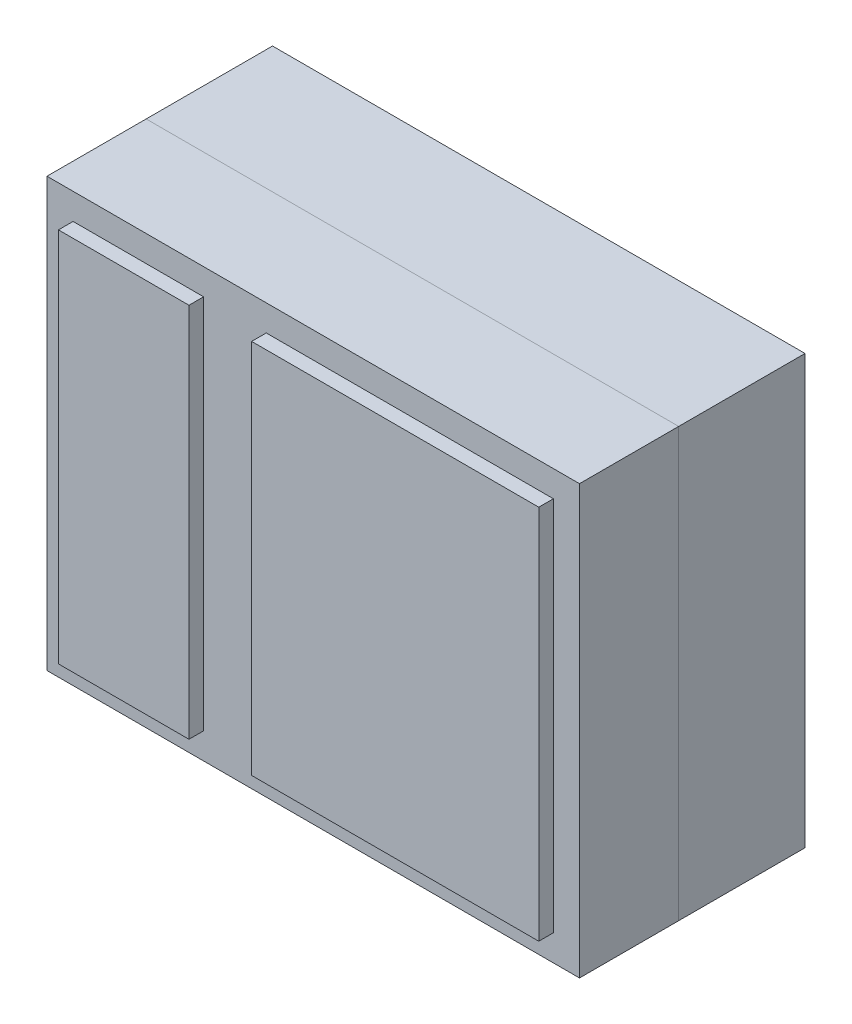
ISO-10303-21;
HEADER;
FILE_DESCRIPTION(('STEP AP214'),'2;1');
FILE_NAME('part.step','',(''),(''),'','','');
FILE_SCHEMA(('AUTOMOTIVE_DESIGN { 1 0 10303 214 1 1 1 1 }'));
ENDSEC;
DATA;
#1=APPLICATION_CONTEXT('core data for automotive mechanical design processes');
#2=APPLICATION_PROTOCOL_DEFINITION('international standard','automotive_design',2000,#1);
#3=PRODUCT_CONTEXT('',#1,'mechanical');
#4=PRODUCT('Part','Part','',(#3));
#5=PRODUCT_RELATED_PRODUCT_CATEGORY('part','',(#4));
#6=PRODUCT_DEFINITION_FORMATION('','',#4);
#7=PRODUCT_DEFINITION_CONTEXT('part definition',#1,'design');
#8=PRODUCT_DEFINITION('design','',#6,#7);
#9=PRODUCT_DEFINITION_SHAPE('','',#8);
#10=(LENGTH_UNIT() NAMED_UNIT(*) SI_UNIT(.MILLI.,.METRE.));
#11=(NAMED_UNIT(*) PLANE_ANGLE_UNIT() SI_UNIT($,.RADIAN.));
#12=(NAMED_UNIT(*) SI_UNIT($,.STERADIAN.) SOLID_ANGLE_UNIT());
#13=UNCERTAINTY_MEASURE_WITH_UNIT(LENGTH_MEASURE(1.E-05),#10,'distance_accuracy_value','');
#14=(GEOMETRIC_REPRESENTATION_CONTEXT(3) GLOBAL_UNCERTAINTY_ASSIGNED_CONTEXT((#13)) GLOBAL_UNIT_ASSIGNED_CONTEXT((#10,
#11,#12)) REPRESENTATION_CONTEXT('',''));
#15=CARTESIAN_POINT('',(0.,0.,0.));
#16=DIRECTION('',(0.,0.,1.));
#17=DIRECTION('',(1.,0.,0.));
#18=AXIS2_PLACEMENT_3D('',#15,#16,#17);
#19=CARTESIAN_POINT('',(1.22,0.,0.92));
#20=DIRECTION('',(1.,0.,0.));
#21=DIRECTION('',(0.,1.,0.));
#22=AXIS2_PLACEMENT_3D('',#19,#20,#21);
#23=PLANE('',#22);
#24=DIRECTION('',(0.,-1.,0.));
#25=VECTOR('',#24,1.);
#26=CARTESIAN_POINT('',(1.22,0.,0.864));
#27=LINE('',#26,#25);
#28=CARTESIAN_POINT('',(1.22,0.719999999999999,0.864));
#29=VERTEX_POINT('',#28);
#30=CARTESIAN_POINT('',(1.22,-0.720000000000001,0.864));
#31=VERTEX_POINT('',#30);
#32=EDGE_CURVE('E114',#29,#31,#27,.T.);
#33=ORIENTED_EDGE('',*,*,#32,.F.);
#34=DIRECTION('',(0.,0.,-1.));
#35=VECTOR('',#34,1.);
#36=CARTESIAN_POINT('',(1.22,0.719999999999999,0.92));
#37=LINE('',#36,#35);
#38=CARTESIAN_POINT('',(1.22,0.719999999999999,0.92));
#39=VERTEX_POINT('',#38);
#40=EDGE_CURVE('E12',#39,#29,#37,.T.);
#41=ORIENTED_EDGE('',*,*,#40,.F.);
#42=DIRECTION('',(0.,-1.,0.));
#43=VECTOR('',#42,1.);
#44=CARTESIAN_POINT('',(1.22,0.,0.92));
#45=LINE('',#44,#43);
#46=CARTESIAN_POINT('',(1.22,-0.720000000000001,0.92));
#47=VERTEX_POINT('',#46);
#48=EDGE_CURVE('E108',#39,#47,#45,.T.);
#49=ORIENTED_EDGE('',*,*,#48,.T.);
#50=DIRECTION('',(0.,0.,-1.));
#51=VECTOR('',#50,1.);
#52=CARTESIAN_POINT('',(1.22,-0.720000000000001,0.92));
#53=LINE('',#52,#51);
#54=EDGE_CURVE('E53',#47,#31,#53,.T.);
#55=ORIENTED_EDGE('',*,*,#54,.T.);
#56=EDGE_LOOP('',(#33,#41,#49,#55));
#57=FACE_BOUND('',#56,.T.);
#58=ADVANCED_FACE('F50',(#57),#23,.T.);
#59=CARTESIAN_POINT('',(0.,0.719999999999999,0.92));
#60=DIRECTION('',(0.,1.,0.));
#61=DIRECTION('',(0.,0.,1.));
#62=AXIS2_PLACEMENT_3D('',#59,#60,#61);
#63=PLANE('',#62);
#64=DIRECTION('',(1.,0.,0.));
#65=VECTOR('',#64,1.);
#66=CARTESIAN_POINT('',(0.,0.719999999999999,0.864));
#67=LINE('',#66,#65);
#68=CARTESIAN_POINT('',(0.120000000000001,0.719999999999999,0.864));
#69=VERTEX_POINT('',#68);
#70=EDGE_CURVE('E110',#69,#29,#67,.T.);
#71=ORIENTED_EDGE('',*,*,#70,.F.);
#72=DIRECTION('',(0.,0.,-1.));
#73=VECTOR('',#72,1.);
#74=CARTESIAN_POINT('',(0.120000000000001,0.719999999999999,0.92));
#75=LINE('',#74,#73);
#76=CARTESIAN_POINT('',(0.120000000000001,0.719999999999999,0.92));
#77=VERTEX_POINT('',#76);
#78=EDGE_CURVE('E59',#77,#69,#75,.T.);
#79=ORIENTED_EDGE('',*,*,#78,.F.);
#80=DIRECTION('',(1.,0.,0.));
#81=VECTOR('',#80,1.);
#82=CARTESIAN_POINT('',(0.,0.719999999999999,0.92));
#83=LINE('',#82,#81);
#84=EDGE_CURVE('E105',#77,#39,#83,.T.);
#85=ORIENTED_EDGE('',*,*,#84,.T.);
#86=ORIENTED_EDGE('',*,*,#40,.T.);
#87=EDGE_LOOP('',(#71,#79,#85,#86));
#88=FACE_BOUND('',#87,.T.);
#89=ADVANCED_FACE('F124',(#88),#63,.T.);
#90=CARTESIAN_POINT('',(0.120000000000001,0.,0.92));
#91=DIRECTION('',(-1.,0.,0.));
#92=DIRECTION('',(0.,-1.,0.));
#93=AXIS2_PLACEMENT_3D('',#90,#91,#92);
#94=PLANE('',#93);
#95=DIRECTION('',(0.,1.,0.));
#96=VECTOR('',#95,1.);
#97=CARTESIAN_POINT('',(0.120000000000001,0.,0.864));
#98=LINE('',#97,#96);
#99=CARTESIAN_POINT('',(0.120000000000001,-0.720000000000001,0.864));
#100=VERTEX_POINT('',#99);
#101=EDGE_CURVE('E100',#100,#69,#98,.T.);
#102=ORIENTED_EDGE('',*,*,#101,.F.);
#103=DIRECTION('',(0.,0.,-1.));
#104=VECTOR('',#103,1.);
#105=CARTESIAN_POINT('',(0.120000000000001,-0.720000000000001,0.92));
#106=LINE('',#105,#104);
#107=CARTESIAN_POINT('',(0.120000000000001,-0.720000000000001,0.92));
#108=VERTEX_POINT('',#107);
#109=EDGE_CURVE('E95',#108,#100,#106,.T.);
#110=ORIENTED_EDGE('',*,*,#109,.F.);
#111=DIRECTION('',(0.,1.,0.));
#112=VECTOR('',#111,1.);
#113=CARTESIAN_POINT('',(0.120000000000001,0.,0.92));
#114=LINE('',#113,#112);
#115=EDGE_CURVE('E98',#108,#77,#114,.T.);
#116=ORIENTED_EDGE('',*,*,#115,.T.);
#117=ORIENTED_EDGE('',*,*,#78,.T.);
#118=EDGE_LOOP('',(#102,#110,#116,#117));
#119=FACE_BOUND('',#118,.T.);
#120=ADVANCED_FACE('F97',(#119),#94,.T.);
#121=CARTESIAN_POINT('',(0.,-0.720000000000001,0.92));
#122=DIRECTION('',(0.,-1.,0.));
#123=DIRECTION('',(1.,0.,0.));
#124=AXIS2_PLACEMENT_3D('',#121,#122,#123);
#125=PLANE('',#124);
#126=DIRECTION('',(-1.,0.,0.));
#127=VECTOR('',#126,1.);
#128=CARTESIAN_POINT('',(0.,-0.720000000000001,0.864));
#129=LINE('',#128,#127);
#130=EDGE_CURVE('E117',#31,#100,#129,.T.);
#131=ORIENTED_EDGE('',*,*,#130,.F.);
#132=ORIENTED_EDGE('',*,*,#54,.F.);
#133=DIRECTION('',(-1.,0.,0.));
#134=VECTOR('',#133,1.);
#135=CARTESIAN_POINT('',(0.,-0.720000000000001,0.92));
#136=LINE('',#135,#134);
#137=EDGE_CURVE('E104',#47,#108,#136,.T.);
#138=ORIENTED_EDGE('',*,*,#137,.T.);
#139=ORIENTED_EDGE('',*,*,#109,.T.);
#140=EDGE_LOOP('',(#131,#132,#138,#139));
#141=FACE_BOUND('',#140,.T.);
#142=ADVANCED_FACE('F107',(#141),#125,.T.);
#143=CARTESIAN_POINT('',(0.,0.,0.92));
#144=DIRECTION('',(0.,0.,-1.));
#145=DIRECTION('',(-1.,0.,0.));
#146=AXIS2_PLACEMENT_3D('',#143,#144,#145);
#147=PLANE('',#146);
#148=ORIENTED_EDGE('',*,*,#48,.F.);
#149=ORIENTED_EDGE('',*,*,#84,.F.);
#150=ORIENTED_EDGE('',*,*,#115,.F.);
#151=ORIENTED_EDGE('',*,*,#137,.F.);
#152=EDGE_LOOP('',(#148,#149,#150,#151));
#153=FACE_BOUND('',#152,.T.);
#154=ADVANCED_FACE('F103',(#153),#147,.F.);
#155=CARTESIAN_POINT('',(0.,0.,0.864));
#156=DIRECTION('',(0.,0.,-1.));
#157=DIRECTION('',(-1.,0.,0.));
#158=AXIS2_PLACEMENT_3D('',#155,#156,#157);
#159=PLANE('',#158);
#160=ORIENTED_EDGE('',*,*,#32,.T.);
#161=ORIENTED_EDGE('',*,*,#130,.T.);
#162=ORIENTED_EDGE('',*,*,#101,.T.);
#163=ORIENTED_EDGE('',*,*,#70,.T.);
#164=EDGE_LOOP('',(#160,#161,#162,#163));
#165=FACE_BOUND('',#164,.T.);
#166=ADVANCED_FACE('F123',(#165),#159,.T.);
#167=CLOSED_SHELL('',(#58,#89,#120,#142,#154,#166));
#168=MANIFOLD_SOLID_BREP('B2',#167);
#169=CARTESIAN_POINT('',(-0.12,0.,0.92));
#170=DIRECTION('',(1.,0.,0.));
#171=DIRECTION('',(0.,0.,-1.));
#172=AXIS2_PLACEMENT_3D('',#169,#170,#171);
#173=PLANE('',#172);
#174=DIRECTION('',(0.,-1.,0.));
#175=VECTOR('',#174,1.);
#176=CARTESIAN_POINT('',(-0.12,0.,0.864));
#177=LINE('',#176,#175);
#178=CARTESIAN_POINT('',(-0.12,0.719999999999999,0.864));
#179=VERTEX_POINT('',#178);
#180=CARTESIAN_POINT('',(-0.12,-0.720000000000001,0.864));
#181=VERTEX_POINT('',#180);
#182=EDGE_CURVE('E248',#179,#181,#177,.T.);
#183=ORIENTED_EDGE('',*,*,#182,.F.);
#184=DIRECTION('',(0.,0.,-1.));
#185=VECTOR('',#184,1.);
#186=CARTESIAN_POINT('',(-0.12,0.719999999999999,0.92));
#187=LINE('',#186,#185);
#188=CARTESIAN_POINT('',(-0.12,0.719999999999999,0.92));
#189=VERTEX_POINT('',#188);
#190=EDGE_CURVE('E48',#189,#179,#187,.T.);
#191=ORIENTED_EDGE('',*,*,#190,.F.);
#192=DIRECTION('',(0.,-1.,0.));
#193=VECTOR('',#192,1.);
#194=CARTESIAN_POINT('',(-0.12,0.,0.92));
#195=LINE('',#194,#193);
#196=CARTESIAN_POINT('',(-0.12,-0.720000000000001,0.92));
#197=VERTEX_POINT('',#196);
#198=EDGE_CURVE('E242',#189,#197,#195,.T.);
#199=ORIENTED_EDGE('',*,*,#198,.T.);
#200=DIRECTION('',(0.,0.,-1.));
#201=VECTOR('',#200,1.);
#202=CARTESIAN_POINT('',(-0.12,-0.720000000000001,0.92));
#203=LINE('',#202,#201);
#204=EDGE_CURVE('E187',#197,#181,#203,.T.);
#205=ORIENTED_EDGE('',*,*,#204,.T.);
#206=EDGE_LOOP('',(#183,#191,#199,#205));
#207=FACE_BOUND('',#206,.T.);
#208=ADVANCED_FACE('F184',(#207),#173,.T.);
#209=CARTESIAN_POINT('',(0.,0.719999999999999,0.92));
#210=DIRECTION('',(0.,1.,0.));
#211=DIRECTION('',(-1.,0.,0.));
#212=AXIS2_PLACEMENT_3D('',#209,#210,#211);
#213=PLANE('',#212);
#214=DIRECTION('',(1.,0.,0.));
#215=VECTOR('',#214,1.);
#216=CARTESIAN_POINT('',(0.,0.719999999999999,0.864));
#217=LINE('',#216,#215);
#218=CARTESIAN_POINT('',(-0.62,0.719999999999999,0.864));
#219=VERTEX_POINT('',#218);
#220=EDGE_CURVE('E244',#219,#179,#217,.T.);
#221=ORIENTED_EDGE('',*,*,#220,.F.);
#222=DIRECTION('',(0.,0.,-1.));
#223=VECTOR('',#222,1.);
#224=CARTESIAN_POINT('',(-0.62,0.719999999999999,0.92));
#225=LINE('',#224,#223);
#226=CARTESIAN_POINT('',(-0.62,0.719999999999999,0.92));
#227=VERTEX_POINT('',#226);
#228=EDGE_CURVE('E193',#227,#219,#225,.T.);
#229=ORIENTED_EDGE('',*,*,#228,.F.);
#230=DIRECTION('',(1.,0.,0.));
#231=VECTOR('',#230,1.);
#232=CARTESIAN_POINT('',(0.,0.719999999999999,0.92));
#233=LINE('',#232,#231);
#234=EDGE_CURVE('E239',#227,#189,#233,.T.);
#235=ORIENTED_EDGE('',*,*,#234,.T.);
#236=ORIENTED_EDGE('',*,*,#190,.T.);
#237=EDGE_LOOP('',(#221,#229,#235,#236));
#238=FACE_BOUND('',#237,.T.);
#239=ADVANCED_FACE('F258',(#238),#213,.T.);
#240=CARTESIAN_POINT('',(-0.62,0.,0.92));
#241=DIRECTION('',(-1.,0.,0.));
#242=DIRECTION('',(0.,0.,1.));
#243=AXIS2_PLACEMENT_3D('',#240,#241,#242);
#244=PLANE('',#243);
#245=DIRECTION('',(0.,1.,0.));
#246=VECTOR('',#245,1.);
#247=CARTESIAN_POINT('',(-0.62,0.,0.864));
#248=LINE('',#247,#246);
#249=CARTESIAN_POINT('',(-0.62,-0.720000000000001,0.864));
#250=VERTEX_POINT('',#249);
#251=EDGE_CURVE('E234',#250,#219,#248,.T.);
#252=ORIENTED_EDGE('',*,*,#251,.F.);
#253=DIRECTION('',(0.,0.,-1.));
#254=VECTOR('',#253,1.);
#255=CARTESIAN_POINT('',(-0.62,-0.720000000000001,0.92));
#256=LINE('',#255,#254);
#257=CARTESIAN_POINT('',(-0.62,-0.720000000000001,0.92));
#258=VERTEX_POINT('',#257);
#259=EDGE_CURVE('E229',#258,#250,#256,.T.);
#260=ORIENTED_EDGE('',*,*,#259,.F.);
#261=DIRECTION('',(0.,1.,0.));
#262=VECTOR('',#261,1.);
#263=CARTESIAN_POINT('',(-0.62,0.,0.92));
#264=LINE('',#263,#262);
#265=EDGE_CURVE('E232',#258,#227,#264,.T.);
#266=ORIENTED_EDGE('',*,*,#265,.T.);
#267=ORIENTED_EDGE('',*,*,#228,.T.);
#268=EDGE_LOOP('',(#252,#260,#266,#267));
#269=FACE_BOUND('',#268,.T.);
#270=ADVANCED_FACE('F231',(#269),#244,.T.);
#271=CARTESIAN_POINT('',(0.,-0.720000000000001,0.92));
#272=DIRECTION('',(0.,-1.,0.));
#273=DIRECTION('',(1.,0.,0.));
#274=AXIS2_PLACEMENT_3D('',#271,#272,#273);
#275=PLANE('',#274);
#276=DIRECTION('',(-1.,0.,0.));
#277=VECTOR('',#276,1.);
#278=CARTESIAN_POINT('',(0.,-0.720000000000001,0.864));
#279=LINE('',#278,#277);
#280=EDGE_CURVE('E251',#181,#250,#279,.T.);
#281=ORIENTED_EDGE('',*,*,#280,.F.);
#282=ORIENTED_EDGE('',*,*,#204,.F.);
#283=DIRECTION('',(-1.,0.,0.));
#284=VECTOR('',#283,1.);
#285=CARTESIAN_POINT('',(0.,-0.720000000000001,0.92));
#286=LINE('',#285,#284);
#287=EDGE_CURVE('E238',#197,#258,#286,.T.);
#288=ORIENTED_EDGE('',*,*,#287,.T.);
#289=ORIENTED_EDGE('',*,*,#259,.T.);
#290=EDGE_LOOP('',(#281,#282,#288,#289));
#291=FACE_BOUND('',#290,.T.);
#292=ADVANCED_FACE('F241',(#291),#275,.T.);
#293=CARTESIAN_POINT('',(0.,0.,0.92));
#294=DIRECTION('',(0.,0.,-1.));
#295=DIRECTION('',(-1.,0.,0.));
#296=AXIS2_PLACEMENT_3D('',#293,#294,#295);
#297=PLANE('',#296);
#298=ORIENTED_EDGE('',*,*,#198,.F.);
#299=ORIENTED_EDGE('',*,*,#234,.F.);
#300=ORIENTED_EDGE('',*,*,#265,.F.);
#301=ORIENTED_EDGE('',*,*,#287,.F.);
#302=EDGE_LOOP('',(#298,#299,#300,#301));
#303=FACE_BOUND('',#302,.T.);
#304=ADVANCED_FACE('F237',(#303),#297,.F.);
#305=CARTESIAN_POINT('',(0.,0.,0.864));
#306=DIRECTION('',(0.,0.,-1.));
#307=DIRECTION('',(-1.,0.,0.));
#308=AXIS2_PLACEMENT_3D('',#305,#306,#307);
#309=PLANE('',#308);
#310=ORIENTED_EDGE('',*,*,#182,.T.);
#311=ORIENTED_EDGE('',*,*,#280,.T.);
#312=ORIENTED_EDGE('',*,*,#251,.T.);
#313=ORIENTED_EDGE('',*,*,#220,.T.);
#314=EDGE_LOOP('',(#310,#311,#312,#313));
#315=FACE_BOUND('',#314,.T.);
#316=ADVANCED_FACE('F257',(#315),#309,.T.);
#317=CLOSED_SHELL('',(#208,#239,#270,#292,#304,#316));
#318=MANIFOLD_SOLID_BREP('B6',#317);
#319=CARTESIAN_POINT('',(1.32,-0.820000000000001,0.864));
#320=DIRECTION('',(-1.,0.,0.));
#321=DIRECTION('',(0.,-1.,0.));
#322=AXIS2_PLACEMENT_3D('',#319,#320,#321);
#323=PLANE('',#322);
#324=DIRECTION('',(0.,1.,0.));
#325=VECTOR('',#324,1.);
#326=CARTESIAN_POINT('',(1.32,-0.820000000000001,0.484));
#327=LINE('',#326,#325);
#328=CARTESIAN_POINT('',(1.32,-0.820000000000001,0.484));
#329=VERTEX_POINT('',#328);
#330=CARTESIAN_POINT('',(1.32,0.819999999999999,0.484));
#331=VERTEX_POINT('',#330);
#332=EDGE_CURVE('E381',#329,#331,#327,.T.);
#333=ORIENTED_EDGE('',*,*,#332,.T.);
#334=DIRECTION('',(0.,0.,-1.));
#335=VECTOR('',#334,1.);
#336=CARTESIAN_POINT('',(1.32,0.819999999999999,0.864));
#337=LINE('',#336,#335);
#338=CARTESIAN_POINT('',(1.32,0.819999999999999,0.864));
#339=VERTEX_POINT('',#338);
#340=EDGE_CURVE('E182',#339,#331,#337,.T.);
#341=ORIENTED_EDGE('',*,*,#340,.F.);
#342=DIRECTION('',(0.,1.,0.));
#343=VECTOR('',#342,1.);
#344=CARTESIAN_POINT('',(1.32,-0.820000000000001,0.864));
#345=LINE('',#344,#343);
#346=CARTESIAN_POINT('',(1.32,-0.820000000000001,0.864));
#347=VERTEX_POINT('',#346);
#348=EDGE_CURVE('E369',#347,#339,#345,.T.);
#349=ORIENTED_EDGE('',*,*,#348,.F.);
#350=DIRECTION('',(0.,0.,-1.));
#351=VECTOR('',#350,1.);
#352=CARTESIAN_POINT('',(1.32,-0.820000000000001,0.864));
#353=LINE('',#352,#351);
#354=EDGE_CURVE('E377',#347,#329,#353,.T.);
#355=ORIENTED_EDGE('',*,*,#354,.T.);
#356=EDGE_LOOP('',(#333,#341,#349,#355));
#357=FACE_BOUND('',#356,.T.);
#358=ADVANCED_FACE('F318',(#357),#323,.F.);
#359=CARTESIAN_POINT('',(1.32,0.819999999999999,0.864));
#360=DIRECTION('',(0.,-1.,0.));
#361=DIRECTION('',(0.,0.,-1.));
#362=AXIS2_PLACEMENT_3D('',#359,#360,#361);
#363=PLANE('',#362);
#364=DIRECTION('',(-1.,0.,0.));
#365=VECTOR('',#364,1.);
#366=CARTESIAN_POINT('',(1.32,0.819999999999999,0.484));
#367=LINE('',#366,#365);
#368=CARTESIAN_POINT('',(-0.72,0.819999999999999,0.484));
#369=VERTEX_POINT('',#368);
#370=EDGE_CURVE('E373',#331,#369,#367,.T.);
#371=ORIENTED_EDGE('',*,*,#370,.T.);
#372=DIRECTION('',(0.,0.,-1.));
#373=VECTOR('',#372,1.);
#374=CARTESIAN_POINT('',(-0.72,0.819999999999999,0.864));
#375=LINE('',#374,#373);
#376=CARTESIAN_POINT('',(-0.72,0.819999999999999,0.864));
#377=VERTEX_POINT('',#376);
#378=EDGE_CURVE('E326',#377,#369,#375,.T.);
#379=ORIENTED_EDGE('',*,*,#378,.F.);
#380=DIRECTION('',(-1.,0.,0.));
#381=VECTOR('',#380,1.);
#382=CARTESIAN_POINT('',(1.32,0.819999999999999,0.864));
#383=LINE('',#382,#381);
#384=EDGE_CURVE('E364',#339,#377,#383,.T.);
#385=ORIENTED_EDGE('',*,*,#384,.F.);
#386=ORIENTED_EDGE('',*,*,#340,.T.);
#387=EDGE_LOOP('',(#371,#379,#385,#386));
#388=FACE_BOUND('',#387,.T.);
#389=ADVANCED_FACE('F372',(#388),#363,.F.);
#390=CARTESIAN_POINT('',(-0.72,0.819999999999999,0.864));
#391=DIRECTION('',(1.,0.,0.));
#392=DIRECTION('',(0.,1.,0.));
#393=AXIS2_PLACEMENT_3D('',#390,#391,#392);
#394=PLANE('',#393);
#395=DIRECTION('',(0.,-1.,0.));
#396=VECTOR('',#395,1.);
#397=CARTESIAN_POINT('',(-0.72,0.819999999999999,0.484));
#398=LINE('',#397,#396);
#399=CARTESIAN_POINT('',(-0.72,-0.820000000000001,0.484));
#400=VERTEX_POINT('',#399);
#401=EDGE_CURVE('E351',#369,#400,#398,.T.);
#402=ORIENTED_EDGE('',*,*,#401,.T.);
#403=DIRECTION('',(0.,0.,-1.));
#404=VECTOR('',#403,1.);
#405=CARTESIAN_POINT('',(-0.72,-0.820000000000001,0.864));
#406=LINE('',#405,#404);
#407=CARTESIAN_POINT('',(-0.72,-0.820000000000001,0.864));
#408=VERTEX_POINT('',#407);
#409=EDGE_CURVE('E374',#408,#400,#406,.T.);
#410=ORIENTED_EDGE('',*,*,#409,.F.);
#411=DIRECTION('',(0.,-1.,0.));
#412=VECTOR('',#411,1.);
#413=CARTESIAN_POINT('',(-0.72,0.819999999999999,0.864));
#414=LINE('',#413,#412);
#415=EDGE_CURVE('E367',#377,#408,#414,.T.);
#416=ORIENTED_EDGE('',*,*,#415,.F.);
#417=ORIENTED_EDGE('',*,*,#378,.T.);
#418=EDGE_LOOP('',(#402,#410,#416,#417));
#419=FACE_BOUND('',#418,.T.);
#420=ADVANCED_FACE('F375',(#419),#394,.F.);
#421=CARTESIAN_POINT('',(-0.72,-0.820000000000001,0.864));
#422=DIRECTION('',(0.,1.,0.));
#423=DIRECTION('',(0.,0.,1.));
#424=AXIS2_PLACEMENT_3D('',#421,#422,#423);
#425=PLANE('',#424);
#426=DIRECTION('',(1.,0.,0.));
#427=VECTOR('',#426,1.);
#428=CARTESIAN_POINT('',(-0.72,-0.820000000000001,0.484));
#429=LINE('',#428,#427);
#430=EDGE_CURVE('E357',#400,#329,#429,.T.);
#431=ORIENTED_EDGE('',*,*,#430,.T.);
#432=ORIENTED_EDGE('',*,*,#354,.F.);
#433=DIRECTION('',(1.,0.,0.));
#434=VECTOR('',#433,1.);
#435=CARTESIAN_POINT('',(-0.72,-0.820000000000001,0.864));
#436=LINE('',#435,#434);
#437=EDGE_CURVE('E334',#408,#347,#436,.T.);
#438=ORIENTED_EDGE('',*,*,#437,.F.);
#439=ORIENTED_EDGE('',*,*,#409,.T.);
#440=EDGE_LOOP('',(#431,#432,#438,#439));
#441=FACE_BOUND('',#440,.T.);
#442=ADVANCED_FACE('F388',(#441),#425,.F.);
#443=CARTESIAN_POINT('',(0.,0.,0.864));
#444=DIRECTION('',(0.,0.,1.));
#445=DIRECTION('',(1.,0.,0.));
#446=AXIS2_PLACEMENT_3D('',#443,#444,#445);
#447=PLANE('',#446);
#448=ORIENTED_EDGE('',*,*,#348,.T.);
#449=ORIENTED_EDGE('',*,*,#384,.T.);
#450=ORIENTED_EDGE('',*,*,#415,.T.);
#451=ORIENTED_EDGE('',*,*,#437,.T.);
#452=EDGE_LOOP('',(#448,#449,#450,#451));
#453=FACE_BOUND('',#452,.T.);
#454=ADVANCED_FACE('F365',(#453),#447,.T.);
#455=CARTESIAN_POINT('',(0.,0.,0.484));
#456=DIRECTION('',(0.,0.,1.));
#457=DIRECTION('',(1.,0.,0.));
#458=AXIS2_PLACEMENT_3D('',#455,#456,#457);
#459=PLANE('',#458);
#460=ORIENTED_EDGE('',*,*,#332,.F.);
#461=ORIENTED_EDGE('',*,*,#430,.F.);
#462=ORIENTED_EDGE('',*,*,#401,.F.);
#463=ORIENTED_EDGE('',*,*,#370,.F.);
#464=EDGE_LOOP('',(#460,#461,#462,#463));
#465=FACE_BOUND('',#464,.T.);
#466=ADVANCED_FACE('F391',(#465),#459,.F.);
#467=CLOSED_SHELL('',(#358,#389,#420,#442,#454,#466));
#468=MANIFOLD_SOLID_BREP('B42',#467);
#469=CARTESIAN_POINT('',(0.712741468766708,0.21,0.328));
#470=DIRECTION('',(1.,0.,0.));
#471=DIRECTION('',(0.,0.,-1.));
#472=AXIS2_PLACEMENT_3D('',#469,#470,#471);
#473=PLANE('',#472);
#474=DIRECTION('',(0.,1.,0.));
#475=VECTOR('',#474,1.);
#476=CARTESIAN_POINT('',(0.712741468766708,0.21,0.428));
#477=LINE('',#476,#475);
#478=CARTESIAN_POINT('',(0.712741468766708,-0.21,0.428));
#479=VERTEX_POINT('',#478);
#480=CARTESIAN_POINT('',(0.712741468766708,0.21,0.428));
#481=VERTEX_POINT('',#480);
#482=EDGE_CURVE('E515',#479,#481,#477,.T.);
#483=ORIENTED_EDGE('',*,*,#482,.T.);
#484=DIRECTION('',(0.,0.,1.));
#485=VECTOR('',#484,1.);
#486=CARTESIAN_POINT('',(0.712741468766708,0.21,0.328));
#487=LINE('',#486,#485);
#488=CARTESIAN_POINT('',(0.712741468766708,0.21,0.328));
#489=VERTEX_POINT('',#488);
#490=EDGE_CURVE('E316',#489,#481,#487,.T.);
#491=ORIENTED_EDGE('',*,*,#490,.F.);
#492=DIRECTION('',(0.,1.,0.));
#493=VECTOR('',#492,1.);
#494=CARTESIAN_POINT('',(0.712741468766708,0.21,0.328));
#495=LINE('',#494,#493);
#496=CARTESIAN_POINT('',(0.712741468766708,-0.21,0.328));
#497=VERTEX_POINT('',#496);
#498=EDGE_CURVE('E503',#497,#489,#495,.T.);
#499=ORIENTED_EDGE('',*,*,#498,.F.);
#500=DIRECTION('',(0.,0.,1.));
#501=VECTOR('',#500,1.);
#502=CARTESIAN_POINT('',(0.712741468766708,-0.21,0.328));
#503=LINE('',#502,#501);
#504=EDGE_CURVE('E511',#497,#479,#503,.T.);
#505=ORIENTED_EDGE('',*,*,#504,.T.);
#506=EDGE_LOOP('',(#483,#491,#499,#505));
#507=FACE_BOUND('',#506,.T.);
#508=ADVANCED_FACE('F452',(#507),#473,.F.);
#509=CARTESIAN_POINT('',(0.932741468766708,0.21,0.328));
#510=DIRECTION('',(0.,-1.,0.));
#511=DIRECTION('',(0.,0.,-1.));
#512=AXIS2_PLACEMENT_3D('',#509,#510,#511);
#513=PLANE('',#512);
#514=DIRECTION('',(1.,0.,0.));
#515=VECTOR('',#514,1.);
#516=CARTESIAN_POINT('',(0.932741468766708,0.21,0.428));
#517=LINE('',#516,#515);
#518=CARTESIAN_POINT('',(0.932741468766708,0.21,0.428));
#519=VERTEX_POINT('',#518);
#520=EDGE_CURVE('E507',#481,#519,#517,.T.);
#521=ORIENTED_EDGE('',*,*,#520,.T.);
#522=DIRECTION('',(0.,0.,1.));
#523=VECTOR('',#522,1.);
#524=CARTESIAN_POINT('',(0.932741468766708,0.21,0.328));
#525=LINE('',#524,#523);
#526=CARTESIAN_POINT('',(0.932741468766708,0.21,0.328));
#527=VERTEX_POINT('',#526);
#528=EDGE_CURVE('E460',#527,#519,#525,.T.);
#529=ORIENTED_EDGE('',*,*,#528,.F.);
#530=DIRECTION('',(1.,0.,0.));
#531=VECTOR('',#530,1.);
#532=CARTESIAN_POINT('',(0.932741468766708,0.21,0.328));
#533=LINE('',#532,#531);
#534=EDGE_CURVE('E498',#489,#527,#533,.T.);
#535=ORIENTED_EDGE('',*,*,#534,.F.);
#536=ORIENTED_EDGE('',*,*,#490,.T.);
#537=EDGE_LOOP('',(#521,#529,#535,#536));
#538=FACE_BOUND('',#537,.T.);
#539=ADVANCED_FACE('F506',(#538),#513,.F.);
#540=CARTESIAN_POINT('',(0.932741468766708,0.21,0.328));
#541=DIRECTION('',(-1.,0.,0.));
#542=DIRECTION('',(0.,0.,1.));
#543=AXIS2_PLACEMENT_3D('',#540,#541,#542);
#544=PLANE('',#543);
#545=DIRECTION('',(0.,-1.,0.));
#546=VECTOR('',#545,1.);
#547=CARTESIAN_POINT('',(0.932741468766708,0.21,0.428));
#548=LINE('',#547,#546);
#549=CARTESIAN_POINT('',(0.932741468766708,-0.21,0.428));
#550=VERTEX_POINT('',#549);
#551=EDGE_CURVE('E485',#519,#550,#548,.T.);
#552=ORIENTED_EDGE('',*,*,#551,.T.);
#553=DIRECTION('',(0.,0.,1.));
#554=VECTOR('',#553,1.);
#555=CARTESIAN_POINT('',(0.932741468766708,-0.21,0.328));
#556=LINE('',#555,#554);
#557=CARTESIAN_POINT('',(0.932741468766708,-0.21,0.328));
#558=VERTEX_POINT('',#557);
#559=EDGE_CURVE('E508',#558,#550,#556,.T.);
#560=ORIENTED_EDGE('',*,*,#559,.F.);
#561=DIRECTION('',(0.,-1.,0.));
#562=VECTOR('',#561,1.);
#563=CARTESIAN_POINT('',(0.932741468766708,0.21,0.328));
#564=LINE('',#563,#562);
#565=EDGE_CURVE('E501',#527,#558,#564,.T.);
#566=ORIENTED_EDGE('',*,*,#565,.F.);
#567=ORIENTED_EDGE('',*,*,#528,.T.);
#568=EDGE_LOOP('',(#552,#560,#566,#567));
#569=FACE_BOUND('',#568,.T.);
#570=ADVANCED_FACE('F509',(#569),#544,.F.);
#571=CARTESIAN_POINT('',(0.932741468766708,-0.21,0.328));
#572=DIRECTION('',(0.,1.,0.));
#573=DIRECTION('',(0.,0.,1.));
#574=AXIS2_PLACEMENT_3D('',#571,#572,#573);
#575=PLANE('',#574);
#576=DIRECTION('',(-1.,0.,0.));
#577=VECTOR('',#576,1.);
#578=CARTESIAN_POINT('',(0.932741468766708,-0.21,0.428));
#579=LINE('',#578,#577);
#580=EDGE_CURVE('E491',#550,#479,#579,.T.);
#581=ORIENTED_EDGE('',*,*,#580,.T.);
#582=ORIENTED_EDGE('',*,*,#504,.F.);
#583=DIRECTION('',(-1.,0.,0.));
#584=VECTOR('',#583,1.);
#585=CARTESIAN_POINT('',(0.932741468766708,-0.21,0.328));
#586=LINE('',#585,#584);
#587=EDGE_CURVE('E468',#558,#497,#586,.T.);
#588=ORIENTED_EDGE('',*,*,#587,.F.);
#589=ORIENTED_EDGE('',*,*,#559,.T.);
#590=EDGE_LOOP('',(#581,#582,#588,#589));
#591=FACE_BOUND('',#590,.T.);
#592=ADVANCED_FACE('F522',(#591),#575,.F.);
#593=CARTESIAN_POINT('',(0.,0.,0.328));
#594=DIRECTION('',(0.,0.,-1.));
#595=DIRECTION('',(-1.,0.,0.));
#596=AXIS2_PLACEMENT_3D('',#593,#594,#595);
#597=PLANE('',#596);
#598=ORIENTED_EDGE('',*,*,#498,.T.);
#599=ORIENTED_EDGE('',*,*,#534,.T.);
#600=ORIENTED_EDGE('',*,*,#565,.T.);
#601=ORIENTED_EDGE('',*,*,#587,.T.);
#602=EDGE_LOOP('',(#598,#599,#600,#601));
#603=FACE_BOUND('',#602,.T.);
#604=ADVANCED_FACE('F499',(#603),#597,.T.);
#605=CARTESIAN_POINT('',(0.,0.,0.428));
#606=DIRECTION('',(0.,0.,-1.));
#607=DIRECTION('',(-1.,0.,0.));
#608=AXIS2_PLACEMENT_3D('',#605,#606,#607);
#609=PLANE('',#608);
#610=ORIENTED_EDGE('',*,*,#482,.F.);
#611=ORIENTED_EDGE('',*,*,#580,.F.);
#612=ORIENTED_EDGE('',*,*,#551,.F.);
#613=ORIENTED_EDGE('',*,*,#520,.F.);
#614=EDGE_LOOP('',(#610,#611,#612,#613));
#615=FACE_BOUND('',#614,.T.);
#616=ADVANCED_FACE('F525',(#615),#609,.F.);
#617=CLOSED_SHELL('',(#508,#539,#570,#592,#604,#616));
#618=MANIFOLD_SOLID_BREP('B176',#617);
#619=CARTESIAN_POINT('',(0.445,0.,0.278));
#620=DIRECTION('',(1.,0.,0.));
#621=DIRECTION('',(0.,1.,0.));
#622=AXIS2_PLACEMENT_3D('',#619,#620,#621);
#623=PLANE('',#622);
#624=DIRECTION('',(0.,1.,0.));
#625=VECTOR('',#624,1.);
#626=CARTESIAN_POINT('',(0.445,0.,0.428));
#627=LINE('',#626,#625);
#628=CARTESIAN_POINT('',(0.445,-0.445,0.428));
#629=VERTEX_POINT('',#628);
#630=CARTESIAN_POINT('',(0.445,0.445,0.428));
#631=VERTEX_POINT('',#630);
#632=EDGE_CURVE('E650',#629,#631,#627,.T.);
#633=ORIENTED_EDGE('',*,*,#632,.F.);
#634=DIRECTION('',(0.,0.,1.));
#635=VECTOR('',#634,1.);
#636=CARTESIAN_POINT('',(0.445,-0.445,0.278));
#637=LINE('',#636,#635);
#638=CARTESIAN_POINT('',(0.445,-0.445,0.278));
#639=VERTEX_POINT('',#638);
#640=EDGE_CURVE('E450',#639,#629,#637,.T.);
#641=ORIENTED_EDGE('',*,*,#640,.F.);
#642=DIRECTION('',(0.,1.,0.));
#643=VECTOR('',#642,1.);
#644=CARTESIAN_POINT('',(0.445,0.,0.278));
#645=LINE('',#644,#643);
#646=CARTESIAN_POINT('',(0.445,0.445,0.278));
#647=VERTEX_POINT('',#646);
#648=EDGE_CURVE('E644',#639,#647,#645,.T.);
#649=ORIENTED_EDGE('',*,*,#648,.T.);
#650=DIRECTION('',(0.,0.,1.));
#651=VECTOR('',#650,1.);
#652=CARTESIAN_POINT('',(0.445,0.445,0.278));
#653=LINE('',#652,#651);
#654=EDGE_CURVE('E589',#647,#631,#653,.T.);
#655=ORIENTED_EDGE('',*,*,#654,.T.);
#656=EDGE_LOOP('',(#633,#641,#649,#655));
#657=FACE_BOUND('',#656,.T.);
#658=ADVANCED_FACE('F586',(#657),#623,.T.);
#659=CARTESIAN_POINT('',(0.,-0.445,0.278));
#660=DIRECTION('',(0.,-1.,0.));
#661=DIRECTION('',(0.,0.,-1.));
#662=AXIS2_PLACEMENT_3D('',#659,#660,#661);
#663=PLANE('',#662);
#664=DIRECTION('',(1.,0.,0.));
#665=VECTOR('',#664,1.);
#666=CARTESIAN_POINT('',(0.,-0.445,0.428));
#667=LINE('',#666,#665);
#668=CARTESIAN_POINT('',(-0.445,-0.445,0.428));
#669=VERTEX_POINT('',#668);
#670=EDGE_CURVE('E646',#669,#629,#667,.T.);
#671=ORIENTED_EDGE('',*,*,#670,.F.);
#672=DIRECTION('',(0.,0.,1.));
#673=VECTOR('',#672,1.);
#674=CARTESIAN_POINT('',(-0.445,-0.445,0.278));
#675=LINE('',#674,#673);
#676=CARTESIAN_POINT('',(-0.445,-0.445,0.278));
#677=VERTEX_POINT('',#676);
#678=EDGE_CURVE('E595',#677,#669,#675,.T.);
#679=ORIENTED_EDGE('',*,*,#678,.F.);
#680=DIRECTION('',(1.,0.,0.));
#681=VECTOR('',#680,1.);
#682=CARTESIAN_POINT('',(0.,-0.445,0.278));
#683=LINE('',#682,#681);
#684=EDGE_CURVE('E641',#677,#639,#683,.T.);
#685=ORIENTED_EDGE('',*,*,#684,.T.);
#686=ORIENTED_EDGE('',*,*,#640,.T.);
#687=EDGE_LOOP('',(#671,#679,#685,#686));
#688=FACE_BOUND('',#687,.T.);
#689=ADVANCED_FACE('F660',(#688),#663,.T.);
#690=CARTESIAN_POINT('',(-0.445,0.,0.278));
#691=DIRECTION('',(-1.,0.,0.));
#692=DIRECTION('',(0.,-1.,0.));
#693=AXIS2_PLACEMENT_3D('',#690,#691,#692);
#694=PLANE('',#693);
#695=DIRECTION('',(0.,-1.,0.));
#696=VECTOR('',#695,1.);
#697=CARTESIAN_POINT('',(-0.445,0.,0.428));
#698=LINE('',#697,#696);
#699=CARTESIAN_POINT('',(-0.445,0.445,0.428));
#700=VERTEX_POINT('',#699);
#701=EDGE_CURVE('E636',#700,#669,#698,.T.);
#702=ORIENTED_EDGE('',*,*,#701,.F.);
#703=DIRECTION('',(0.,0.,1.));
#704=VECTOR('',#703,1.);
#705=CARTESIAN_POINT('',(-0.445,0.445,0.278));
#706=LINE('',#705,#704);
#707=CARTESIAN_POINT('',(-0.445,0.445,0.278));
#708=VERTEX_POINT('',#707);
#709=EDGE_CURVE('E631',#708,#700,#706,.T.);
#710=ORIENTED_EDGE('',*,*,#709,.F.);
#711=DIRECTION('',(0.,-1.,0.));
#712=VECTOR('',#711,1.);
#713=CARTESIAN_POINT('',(-0.445,0.,0.278));
#714=LINE('',#713,#712);
#715=EDGE_CURVE('E634',#708,#677,#714,.T.);
#716=ORIENTED_EDGE('',*,*,#715,.T.);
#717=ORIENTED_EDGE('',*,*,#678,.T.);
#718=EDGE_LOOP('',(#702,#710,#716,#717));
#719=FACE_BOUND('',#718,.T.);
#720=ADVANCED_FACE('F633',(#719),#694,.T.);
#721=CARTESIAN_POINT('',(0.,0.445,0.278));
#722=DIRECTION('',(0.,1.,0.));
#723=DIRECTION('',(0.,0.,1.));
#724=AXIS2_PLACEMENT_3D('',#721,#722,#723);
#725=PLANE('',#724);
#726=DIRECTION('',(-1.,0.,0.));
#727=VECTOR('',#726,1.);
#728=CARTESIAN_POINT('',(0.,0.445,0.428));
#729=LINE('',#728,#727);
#730=EDGE_CURVE('E653',#631,#700,#729,.T.);
#731=ORIENTED_EDGE('',*,*,#730,.F.);
#732=ORIENTED_EDGE('',*,*,#654,.F.);
#733=DIRECTION('',(-1.,0.,0.));
#734=VECTOR('',#733,1.);
#735=CARTESIAN_POINT('',(0.,0.445,0.278));
#736=LINE('',#735,#734);
#737=EDGE_CURVE('E640',#647,#708,#736,.T.);
#738=ORIENTED_EDGE('',*,*,#737,.T.);
#739=ORIENTED_EDGE('',*,*,#709,.T.);
#740=EDGE_LOOP('',(#731,#732,#738,#739));
#741=FACE_BOUND('',#740,.T.);
#742=ADVANCED_FACE('F643',(#741),#725,.T.);
#743=CARTESIAN_POINT('',(0.,0.,0.278));
#744=DIRECTION('',(0.,0.,1.));
#745=DIRECTION('',(1.,0.,0.));
#746=AXIS2_PLACEMENT_3D('',#743,#744,#745);
#747=PLANE('',#746);
#748=ORIENTED_EDGE('',*,*,#648,.F.);
#749=ORIENTED_EDGE('',*,*,#684,.F.);
#750=ORIENTED_EDGE('',*,*,#715,.F.);
#751=ORIENTED_EDGE('',*,*,#737,.F.);
#752=EDGE_LOOP('',(#748,#749,#750,#751));
#753=FACE_BOUND('',#752,.T.);
#754=ADVANCED_FACE('F639',(#753),#747,.F.);
#755=CARTESIAN_POINT('',(0.,0.,0.428));
#756=DIRECTION('',(0.,0.,1.));
#757=DIRECTION('',(1.,0.,0.));
#758=AXIS2_PLACEMENT_3D('',#755,#756,#757);
#759=PLANE('',#758);
#760=ORIENTED_EDGE('',*,*,#632,.T.);
#761=ORIENTED_EDGE('',*,*,#730,.T.);
#762=ORIENTED_EDGE('',*,*,#701,.T.);
#763=ORIENTED_EDGE('',*,*,#670,.T.);
#764=EDGE_LOOP('',(#760,#761,#762,#763));
#765=FACE_BOUND('',#764,.T.);
#766=ADVANCED_FACE('F659',(#765),#759,.T.);
#767=CLOSED_SHELL('',(#658,#689,#720,#742,#754,#766));
#768=MANIFOLD_SOLID_BREP('B310',#767);
#769=CARTESIAN_POINT('',(0.78,0.,0.428));
#770=DIRECTION('',(1.,0.,0.));
#771=DIRECTION('',(0.,1.,0.));
#772=AXIS2_PLACEMENT_3D('',#769,#770,#771);
#773=PLANE('',#772);
#774=DIRECTION('',(0.,1.,0.));
#775=VECTOR('',#774,1.);
#776=CARTESIAN_POINT('',(0.78,0.,0.484));
#777=LINE('',#776,#775);
#778=CARTESIAN_POINT('',(0.780000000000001,0.249999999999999,0.484));
#779=VERTEX_POINT('',#778);
#780=CARTESIAN_POINT('',(0.780000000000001,0.719999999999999,0.484));
#781=VERTEX_POINT('',#780);
#782=EDGE_CURVE('E829',#779,#781,#777,.T.);
#783=ORIENTED_EDGE('',*,*,#782,.F.);
#784=DIRECTION('',(0.,0.,1.));
#785=VECTOR('',#784,1.);
#786=CARTESIAN_POINT('',(0.780000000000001,0.249999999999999,0.428));
#787=LINE('',#786,#785);
#788=CARTESIAN_POINT('',(0.780000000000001,0.249999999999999,0.428));
#789=VERTEX_POINT('',#788);
#790=EDGE_CURVE('E584',#789,#779,#787,.T.);
#791=ORIENTED_EDGE('',*,*,#790,.F.);
#792=DIRECTION('',(0.,1.,0.));
#793=VECTOR('',#792,1.);
#794=CARTESIAN_POINT('',(0.78,0.,0.428));
#795=LINE('',#794,#793);
#796=CARTESIAN_POINT('',(0.780000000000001,0.719999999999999,0.428));
#797=VERTEX_POINT('',#796);
#798=EDGE_CURVE('E855',#789,#797,#795,.T.);
#799=ORIENTED_EDGE('',*,*,#798,.T.);
#800=DIRECTION('',(0.,0.,1.));
#801=VECTOR('',#800,1.);
#802=CARTESIAN_POINT('',(0.780000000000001,0.719999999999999,0.428));
#803=LINE('',#802,#801);
#804=EDGE_CURVE('E723',#797,#781,#803,.T.);
#805=ORIENTED_EDGE('',*,*,#804,.T.);
#806=EDGE_LOOP('',(#783,#791,#799,#805));
#807=FACE_BOUND('',#806,.T.);
#808=ADVANCED_FACE('F720',(#807),#773,.T.);
#809=CARTESIAN_POINT('',(0.,0.249999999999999,0.428));
#810=DIRECTION('',(0.,1.,0.));
#811=DIRECTION('',(0.,0.,1.));
#812=AXIS2_PLACEMENT_3D('',#809,#810,#811);
#813=PLANE('',#812);
#814=DIRECTION('',(-1.,0.,0.));
#815=VECTOR('',#814,1.);
#816=CARTESIAN_POINT('',(0.,0.249999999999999,0.484));
#817=LINE('',#816,#815);
#818=CARTESIAN_POINT('',(0.860000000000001,0.249999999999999,0.484));
#819=VERTEX_POINT('',#818);
#820=EDGE_CURVE('E853',#819,#779,#817,.T.);
#821=ORIENTED_EDGE('',*,*,#820,.F.);
#822=DIRECTION('',(0.,0.,1.));
#823=VECTOR('',#822,1.);
#824=CARTESIAN_POINT('',(0.860000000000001,0.249999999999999,0.428));
#825=LINE('',#824,#823);
#826=CARTESIAN_POINT('',(0.860000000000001,0.249999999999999,0.428));
#827=VERTEX_POINT('',#826);
#828=EDGE_CURVE('E729',#827,#819,#825,.T.);
#829=ORIENTED_EDGE('',*,*,#828,.F.);
#830=DIRECTION('',(-1.,0.,0.));
#831=VECTOR('',#830,1.);
#832=CARTESIAN_POINT('',(0.,0.249999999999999,0.428));
#833=LINE('',#832,#831);
#834=EDGE_CURVE('E819',#827,#789,#833,.T.);
#835=ORIENTED_EDGE('',*,*,#834,.T.);
#836=ORIENTED_EDGE('',*,*,#790,.T.);
#837=EDGE_LOOP('',(#821,#829,#835,#836));
#838=FACE_BOUND('',#837,.T.);
#839=ADVANCED_FACE('F871',(#838),#813,.T.);
#840=CARTESIAN_POINT('',(0.860000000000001,0.,0.428));
#841=DIRECTION('',(-1.,0.,0.));
#842=DIRECTION('',(0.,0.,1.));
#843=AXIS2_PLACEMENT_3D('',#840,#841,#842);
#844=PLANE('',#843);
#845=DIRECTION('',(0.,-1.,0.));
#846=VECTOR('',#845,1.);
#847=CARTESIAN_POINT('',(0.860000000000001,0.,0.484));
#848=LINE('',#847,#846);
#849=CARTESIAN_POINT('',(0.860000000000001,0.619999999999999,0.484));
#850=VERTEX_POINT('',#849);
#851=EDGE_CURVE('E806',#850,#819,#848,.T.);
#852=ORIENTED_EDGE('',*,*,#851,.F.);
#853=DIRECTION('',(0.,0.,1.));
#854=VECTOR('',#853,1.);
#855=CARTESIAN_POINT('',(0.860000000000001,0.619999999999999,0.428));
#856=LINE('',#855,#854);
#857=CARTESIAN_POINT('',(0.860000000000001,0.619999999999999,0.428));
#858=VERTEX_POINT('',#857);
#859=EDGE_CURVE('E801',#858,#850,#856,.T.);
#860=ORIENTED_EDGE('',*,*,#859,.F.);
#861=DIRECTION('',(0.,-1.,0.));
#862=VECTOR('',#861,1.);
#863=CARTESIAN_POINT('',(0.860000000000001,0.,0.428));
#864=LINE('',#863,#862);
#865=EDGE_CURVE('E804',#858,#827,#864,.T.);
#866=ORIENTED_EDGE('',*,*,#865,.T.);
#867=ORIENTED_EDGE('',*,*,#828,.T.);
#868=EDGE_LOOP('',(#852,#860,#866,#867));
#869=FACE_BOUND('',#868,.T.);
#870=ADVANCED_FACE('F803',(#869),#844,.T.);
#871=CARTESIAN_POINT('',(0.,0.619999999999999,0.428));
#872=DIRECTION('',(0.,1.,0.));
#873=DIRECTION('',(0.,0.,1.));
#874=AXIS2_PLACEMENT_3D('',#871,#872,#873);
#875=PLANE('',#874);
#876=DIRECTION('',(-1.,0.,0.));
#877=VECTOR('',#876,1.);
#878=CARTESIAN_POINT('',(0.,0.619999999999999,0.484));
#879=LINE('',#878,#877);
#880=CARTESIAN_POINT('',(1.11,0.619999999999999,0.484));
#881=VERTEX_POINT('',#880);
#882=EDGE_CURVE('E850',#881,#850,#879,.T.);
#883=ORIENTED_EDGE('',*,*,#882,.F.);
#884=DIRECTION('',(0.,0.,1.));
#885=VECTOR('',#884,1.);
#886=CARTESIAN_POINT('',(1.11,0.619999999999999,0.428));
#887=LINE('',#886,#885);
#888=CARTESIAN_POINT('',(1.11,0.619999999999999,0.428));
#889=VERTEX_POINT('',#888);
#890=EDGE_CURVE('E811',#889,#881,#887,.T.);
#891=ORIENTED_EDGE('',*,*,#890,.F.);
#892=DIRECTION('',(-1.,0.,0.));
#893=VECTOR('',#892,1.);
#894=CARTESIAN_POINT('',(0.,0.619999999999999,0.428));
#895=LINE('',#894,#893);
#896=EDGE_CURVE('E817',#889,#858,#895,.T.);
#897=ORIENTED_EDGE('',*,*,#896,.T.);
#898=ORIENTED_EDGE('',*,*,#859,.T.);
#899=EDGE_LOOP('',(#883,#891,#897,#898));
#900=FACE_BOUND('',#899,.T.);
#901=ADVANCED_FACE('F821',(#900),#875,.T.);
#902=CARTESIAN_POINT('',(1.11,0.,0.428));
#903=DIRECTION('',(1.,0.,0.));
#904=DIRECTION('',(0.,0.,-1.));
#905=AXIS2_PLACEMENT_3D('',#902,#903,#904);
#906=PLANE('',#905);
#907=DIRECTION('',(0.,1.,0.));
#908=VECTOR('',#907,1.);
#909=CARTESIAN_POINT('',(1.11,0.,0.484));
#910=LINE('',#909,#908);
#911=CARTESIAN_POINT('',(1.11,0.0399999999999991,0.484));
#912=VERTEX_POINT('',#911);
#913=EDGE_CURVE('E847',#912,#881,#910,.T.);
#914=ORIENTED_EDGE('',*,*,#913,.F.);
#915=DIRECTION('',(0.,0.,1.));
#916=VECTOR('',#915,1.);
#917=CARTESIAN_POINT('',(1.11,0.0399999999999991,0.428));
#918=LINE('',#917,#916);
#919=CARTESIAN_POINT('',(1.11,0.0399999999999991,0.428));
#920=VERTEX_POINT('',#919);
#921=EDGE_CURVE('E859',#920,#912,#918,.T.);
#922=ORIENTED_EDGE('',*,*,#921,.F.);
#923=DIRECTION('',(0.,1.,0.));
#924=VECTOR('',#923,1.);
#925=CARTESIAN_POINT('',(1.11,0.,0.428));
#926=LINE('',#925,#924);
#927=EDGE_CURVE('E822',#920,#889,#926,.T.);
#928=ORIENTED_EDGE('',*,*,#927,.T.);
#929=ORIENTED_EDGE('',*,*,#890,.T.);
#930=EDGE_LOOP('',(#914,#922,#928,#929));
#931=FACE_BOUND('',#930,.T.);
#932=ADVANCED_FACE('F884',(#931),#906,.T.);
#933=CARTESIAN_POINT('',(0.,0.0399999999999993,0.428));
#934=DIRECTION('',(0.,-1.,0.));
#935=DIRECTION('',(1.,0.,0.));
#936=AXIS2_PLACEMENT_3D('',#933,#934,#935);
#937=PLANE('',#936);
#938=DIRECTION('',(1.,0.,0.));
#939=VECTOR('',#938,1.);
#940=CARTESIAN_POINT('',(0.,0.0399999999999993,0.484));
#941=LINE('',#940,#939);
#942=CARTESIAN_POINT('',(-0.62,0.0399999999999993,0.484));
#943=VERTEX_POINT('',#942);
#944=EDGE_CURVE('E844',#943,#912,#941,.T.);
#945=ORIENTED_EDGE('',*,*,#944,.F.);
#946=DIRECTION('',(0.,0.,1.));
#947=VECTOR('',#946,1.);
#948=CARTESIAN_POINT('',(-0.62,0.0399999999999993,0.428));
#949=LINE('',#948,#947);
#950=CARTESIAN_POINT('',(-0.62,0.0399999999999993,0.428));
#951=VERTEX_POINT('',#950);
#952=EDGE_CURVE('E861',#951,#943,#949,.T.);
#953=ORIENTED_EDGE('',*,*,#952,.F.);
#954=DIRECTION('',(1.,0.,0.));
#955=VECTOR('',#954,1.);
#956=CARTESIAN_POINT('',(0.,0.0399999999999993,0.428));
#957=LINE('',#956,#955);
#958=EDGE_CURVE('E824',#951,#920,#957,.T.);
#959=ORIENTED_EDGE('',*,*,#958,.T.);
#960=ORIENTED_EDGE('',*,*,#921,.T.);
#961=EDGE_LOOP('',(#945,#953,#959,#960));
#962=FACE_BOUND('',#961,.T.);
#963=ADVANCED_FACE('F887',(#962),#937,.T.);
#964=CARTESIAN_POINT('',(-0.62,0.,0.428));
#965=DIRECTION('',(-1.,0.,0.));
#966=DIRECTION('',(0.,0.,1.));
#967=AXIS2_PLACEMENT_3D('',#964,#965,#966);
#968=PLANE('',#967);
#969=DIRECTION('',(0.,-1.,0.));
#970=VECTOR('',#969,1.);
#971=CARTESIAN_POINT('',(-0.62,0.,0.484));
#972=LINE('',#971,#970);
#973=CARTESIAN_POINT('',(-0.62,0.619999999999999,0.484));
#974=VERTEX_POINT('',#973);
#975=EDGE_CURVE('E841',#974,#943,#972,.T.);
#976=ORIENTED_EDGE('',*,*,#975,.F.);
#977=DIRECTION('',(0.,0.,1.));
#978=VECTOR('',#977,1.);
#979=CARTESIAN_POINT('',(-0.62,0.619999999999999,0.428));
#980=LINE('',#979,#978);
#981=CARTESIAN_POINT('',(-0.62,0.619999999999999,0.428));
#982=VERTEX_POINT('',#981);
#983=EDGE_CURVE('E863',#982,#974,#980,.T.);
#984=ORIENTED_EDGE('',*,*,#983,.F.);
#985=DIRECTION('',(0.,-1.,0.));
#986=VECTOR('',#985,1.);
#987=CARTESIAN_POINT('',(-0.62,0.,0.428));
#988=LINE('',#987,#986);
#989=EDGE_CURVE('E986',#982,#951,#988,.T.);
#990=ORIENTED_EDGE('',*,*,#989,.T.);
#991=ORIENTED_EDGE('',*,*,#952,.T.);
#992=EDGE_LOOP('',(#976,#984,#990,#991));
#993=FACE_BOUND('',#992,.T.);
#994=ADVANCED_FACE('F891',(#993),#968,.T.);
#995=CARTESIAN_POINT('',(0.,0.619999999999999,0.428));
#996=DIRECTION('',(0.,1.,0.));
#997=DIRECTION('',(0.,0.,1.));
#998=AXIS2_PLACEMENT_3D('',#995,#996,#997);
#999=PLANE('',#998);
#1000=DIRECTION('',(-1.,0.,0.));
#1001=VECTOR('',#1000,1.);
#1002=CARTESIAN_POINT('',(0.,0.619999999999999,0.484));
#1003=LINE('',#1002,#1001);
#1004=CARTESIAN_POINT('',(-0.52,0.619999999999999,0.484));
#1005=VERTEX_POINT('',#1004);
#1006=EDGE_CURVE('E838',#1005,#974,#1003,.T.);
#1007=ORIENTED_EDGE('',*,*,#1006,.F.);
#1008=DIRECTION('',(0.,0.,1.));
#1009=VECTOR('',#1008,1.);
#1010=CARTESIAN_POINT('',(-0.52,0.619999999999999,0.428));
#1011=LINE('',#1010,#1009);
#1012=CARTESIAN_POINT('',(-0.52,0.619999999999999,0.428));
#1013=VERTEX_POINT('',#1012);
#1014=EDGE_CURVE('E865',#1013,#1005,#1011,.T.);
#1015=ORIENTED_EDGE('',*,*,#1014,.F.);
#1016=DIRECTION('',(-1.,0.,0.));
#1017=VECTOR('',#1016,1.);
#1018=CARTESIAN_POINT('',(0.,0.619999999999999,0.428));
#1019=LINE('',#1018,#1017);
#1020=EDGE_CURVE('E982',#1013,#982,#1019,.T.);
#1021=ORIENTED_EDGE('',*,*,#1020,.T.);
#1022=ORIENTED_EDGE('',*,*,#983,.T.);
#1023=EDGE_LOOP('',(#1007,#1015,#1021,#1022));
#1024=FACE_BOUND('',#1023,.T.);
#1025=ADVANCED_FACE('F895',(#1024),#999,.T.);
#1026=CARTESIAN_POINT('',(-0.52,0.,0.428));
#1027=DIRECTION('',(-1.,0.,0.));
#1028=DIRECTION('',(0.,0.,1.));
#1029=AXIS2_PLACEMENT_3D('',#1026,#1027,#1028);
#1030=PLANE('',#1029);
#1031=DIRECTION('',(0.,-1.,0.));
#1032=VECTOR('',#1031,1.);
#1033=CARTESIAN_POINT('',(-0.52,0.,0.484));
#1034=LINE('',#1033,#1032);
#1035=CARTESIAN_POINT('',(-0.52,0.719999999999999,0.484));
#1036=VERTEX_POINT('',#1035);
#1037=EDGE_CURVE('E835',#1036,#1005,#1034,.T.);
#1038=ORIENTED_EDGE('',*,*,#1037,.F.);
#1039=DIRECTION('',(0.,0.,1.));
#1040=VECTOR('',#1039,1.);
#1041=CARTESIAN_POINT('',(-0.52,0.719999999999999,0.428));
#1042=LINE('',#1041,#1040);
#1043=CARTESIAN_POINT('',(-0.52,0.719999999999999,0.428));
#1044=VERTEX_POINT('',#1043);
#1045=EDGE_CURVE('E866',#1044,#1036,#1042,.T.);
#1046=ORIENTED_EDGE('',*,*,#1045,.F.);
#1047=DIRECTION('',(0.,-1.,0.));
#1048=VECTOR('',#1047,1.);
#1049=CARTESIAN_POINT('',(-0.52,0.,0.428));
#1050=LINE('',#1049,#1048);
#1051=EDGE_CURVE('E993',#1044,#1013,#1050,.T.);
#1052=ORIENTED_EDGE('',*,*,#1051,.T.);
#1053=ORIENTED_EDGE('',*,*,#1014,.T.);
#1054=EDGE_LOOP('',(#1038,#1046,#1052,#1053));
#1055=FACE_BOUND('',#1054,.T.);
#1056=ADVANCED_FACE('F899',(#1055),#1030,.T.);
#1057=CARTESIAN_POINT('',(0.,0.719999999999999,0.428));
#1058=DIRECTION('',(0.,1.,0.));
#1059=DIRECTION('',(0.,0.,1.));
#1060=AXIS2_PLACEMENT_3D('',#1057,#1058,#1059);
#1061=PLANE('',#1060);
#1062=DIRECTION('',(-1.,0.,0.));
#1063=VECTOR('',#1062,1.);
#1064=CARTESIAN_POINT('',(0.,0.719999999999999,0.484));
#1065=LINE('',#1064,#1063);
#1066=EDGE_CURVE('E832',#781,#1036,#1065,.T.);
#1067=ORIENTED_EDGE('',*,*,#1066,.F.);
#1068=ORIENTED_EDGE('',*,*,#804,.F.);
#1069=DIRECTION('',(-1.,0.,0.));
#1070=VECTOR('',#1069,1.);
#1071=CARTESIAN_POINT('',(0.,0.719999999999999,0.428));
#1072=LINE('',#1071,#1070);
#1073=EDGE_CURVE('E995',#797,#1044,#1072,.T.);
#1074=ORIENTED_EDGE('',*,*,#1073,.T.);
#1075=ORIENTED_EDGE('',*,*,#1045,.T.);
#1076=EDGE_LOOP('',(#1067,#1068,#1074,#1075));
#1077=FACE_BOUND('',#1076,.T.);
#1078=ADVANCED_FACE('F868',(#1077),#1061,.T.);
#1079=CARTESIAN_POINT('',(0.,0.,0.428));
#1080=DIRECTION('',(0.,0.,1.));
#1081=DIRECTION('',(1.,0.,0.));
#1082=AXIS2_PLACEMENT_3D('',#1079,#1080,#1081);
#1083=PLANE('',#1082);
#1084=ORIENTED_EDGE('',*,*,#798,.F.);
#1085=ORIENTED_EDGE('',*,*,#834,.F.);
#1086=ORIENTED_EDGE('',*,*,#865,.F.);
#1087=ORIENTED_EDGE('',*,*,#896,.F.);
#1088=ORIENTED_EDGE('',*,*,#927,.F.);
#1089=ORIENTED_EDGE('',*,*,#958,.F.);
#1090=ORIENTED_EDGE('',*,*,#989,.F.);
#1091=ORIENTED_EDGE('',*,*,#1020,.F.);
#1092=ORIENTED_EDGE('',*,*,#1051,.F.);
#1093=ORIENTED_EDGE('',*,*,#1073,.F.);
#1094=EDGE_LOOP('',(#1084,#1085,#1086,#1087,#1088,#1089,#1090,#1091,#1092,#1093));
#1095=FACE_BOUND('',#1094,.T.);
#1096=ADVANCED_FACE('F815',(#1095),#1083,.F.);
#1097=CARTESIAN_POINT('',(0.,0.,0.484));
#1098=DIRECTION('',(0.,0.,1.));
#1099=DIRECTION('',(1.,0.,0.));
#1100=AXIS2_PLACEMENT_3D('',#1097,#1098,#1099);
#1101=PLANE('',#1100);
#1102=ORIENTED_EDGE('',*,*,#782,.T.);
#1103=ORIENTED_EDGE('',*,*,#1066,.T.);
#1104=ORIENTED_EDGE('',*,*,#1037,.T.);
#1105=ORIENTED_EDGE('',*,*,#1006,.T.);
#1106=ORIENTED_EDGE('',*,*,#975,.T.);
#1107=ORIENTED_EDGE('',*,*,#944,.T.);
#1108=ORIENTED_EDGE('',*,*,#913,.T.);
#1109=ORIENTED_EDGE('',*,*,#882,.T.);
#1110=ORIENTED_EDGE('',*,*,#851,.T.);
#1111=ORIENTED_EDGE('',*,*,#820,.T.);
#1112=EDGE_LOOP('',(#1102,#1103,#1104,#1105,#1106,#1107,#1108,#1109,#1110,#1111));
#1113=FACE_BOUND('',#1112,.T.);
#1114=ADVANCED_FACE('F870',(#1113),#1101,.T.);
#1115=CLOSED_SHELL('',(#808,#839,#870,#901,#932,#963,#994,#1025,#1056,#1078,#1096,#1114));
#1116=MANIFOLD_SOLID_BREP('B444',#1115);
#1117=CARTESIAN_POINT('',(-0.520000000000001,0.,0.428));
#1118=DIRECTION('',(-1.,0.,0.));
#1119=DIRECTION('',(0.,-1.,0.));
#1120=AXIS2_PLACEMENT_3D('',#1117,#1118,#1119);
#1121=PLANE('',#1120);
#1122=DIRECTION('',(0.,-1.,0.));
#1123=VECTOR('',#1122,1.);
#1124=CARTESIAN_POINT('',(-0.520000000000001,0.,0.484));
#1125=LINE('',#1124,#1123);
#1126=CARTESIAN_POINT('',(-0.52,-0.620000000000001,0.484));
#1127=VERTEX_POINT('',#1126);
#1128=CARTESIAN_POINT('',(-0.52,-0.720000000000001,0.484));
#1129=VERTEX_POINT('',#1128);
#1130=EDGE_CURVE('E1106',#1127,#1129,#1125,.T.);
#1131=ORIENTED_EDGE('',*,*,#1130,.F.);
#1132=DIRECTION('',(0.,0.,1.));
#1133=VECTOR('',#1132,1.);
#1134=CARTESIAN_POINT('',(-0.52,-0.620000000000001,0.428));
#1135=LINE('',#1134,#1133);
#1136=CARTESIAN_POINT('',(-0.52,-0.620000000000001,0.428));
#1137=VERTEX_POINT('',#1136);
#1138=EDGE_CURVE('E718',#1137,#1127,#1135,.T.);
#1139=ORIENTED_EDGE('',*,*,#1138,.F.);
#1140=DIRECTION('',(0.,-1.,0.));
#1141=VECTOR('',#1140,1.);
#1142=CARTESIAN_POINT('',(-0.520000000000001,0.,0.428));
#1143=LINE('',#1142,#1141);
#1144=CARTESIAN_POINT('',(-0.52,-0.720000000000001,0.428));
#1145=VERTEX_POINT('',#1144);
#1146=EDGE_CURVE('E1126',#1137,#1145,#1143,.T.);
#1147=ORIENTED_EDGE('',*,*,#1146,.T.);
#1148=DIRECTION('',(0.,0.,1.));
#1149=VECTOR('',#1148,1.);
#1150=CARTESIAN_POINT('',(-0.52,-0.720000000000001,0.428));
#1151=LINE('',#1150,#1149);
#1152=EDGE_CURVE('E1012',#1145,#1129,#1151,.T.);
#1153=ORIENTED_EDGE('',*,*,#1152,.T.);
#1154=EDGE_LOOP('',(#1131,#1139,#1147,#1153));
#1155=FACE_BOUND('',#1154,.T.);
#1156=ADVANCED_FACE('F1009',(#1155),#1121,.T.);
#1157=CARTESIAN_POINT('',(0.,-0.620000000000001,0.428));
#1158=DIRECTION('',(0.,-1.,0.));
#1159=DIRECTION('',(0.,0.,-1.));
#1160=AXIS2_PLACEMENT_3D('',#1157,#1158,#1159);
#1161=PLANE('',#1160);
#1162=DIRECTION('',(1.,0.,0.));
#1163=VECTOR('',#1162,1.);
#1164=CARTESIAN_POINT('',(0.,-0.620000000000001,0.484));
#1165=LINE('',#1164,#1163);
#1166=CARTESIAN_POINT('',(-0.62,-0.620000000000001,0.484));
#1167=VERTEX_POINT('',#1166);
#1168=EDGE_CURVE('E1124',#1167,#1127,#1165,.T.);
#1169=ORIENTED_EDGE('',*,*,#1168,.F.);
#1170=DIRECTION('',(0.,0.,1.));
#1171=VECTOR('',#1170,1.);
#1172=CARTESIAN_POINT('',(-0.62,-0.620000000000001,0.428));
#1173=LINE('',#1172,#1171);
#1174=CARTESIAN_POINT('',(-0.62,-0.620000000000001,0.428));
#1175=VERTEX_POINT('',#1174);
#1176=EDGE_CURVE('E1018',#1175,#1167,#1173,.T.);
#1177=ORIENTED_EDGE('',*,*,#1176,.F.);
#1178=DIRECTION('',(1.,0.,0.));
#1179=VECTOR('',#1178,1.);
#1180=CARTESIAN_POINT('',(0.,-0.620000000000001,0.428));
#1181=LINE('',#1180,#1179);
#1182=EDGE_CURVE('E1096',#1175,#1137,#1181,.T.);
#1183=ORIENTED_EDGE('',*,*,#1182,.T.);
#1184=ORIENTED_EDGE('',*,*,#1138,.T.);
#1185=EDGE_LOOP('',(#1169,#1177,#1183,#1184));
#1186=FACE_BOUND('',#1185,.T.);
#1187=ADVANCED_FACE('F1138',(#1186),#1161,.T.);
#1188=CARTESIAN_POINT('',(-0.62,0.,0.428));
#1189=DIRECTION('',(-1.,0.,0.));
#1190=DIRECTION('',(0.,0.,1.));
#1191=AXIS2_PLACEMENT_3D('',#1188,#1189,#1190);
#1192=PLANE('',#1191);
#1193=DIRECTION('',(0.,-1.,0.));
#1194=VECTOR('',#1193,1.);
#1195=CARTESIAN_POINT('',(-0.62,0.,0.484));
#1196=LINE('',#1195,#1194);
#1197=CARTESIAN_POINT('',(-0.62,-0.0400000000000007,0.484));
#1198=VERTEX_POINT('',#1197);
#1199=EDGE_CURVE('E1083',#1198,#1167,#1196,.T.);
#1200=ORIENTED_EDGE('',*,*,#1199,.F.);
#1201=DIRECTION('',(0.,0.,1.));
#1202=VECTOR('',#1201,1.);
#1203=CARTESIAN_POINT('',(-0.62,-0.0400000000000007,0.428));
#1204=LINE('',#1203,#1202);
#1205=CARTESIAN_POINT('',(-0.62,-0.0400000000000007,0.428));
#1206=VERTEX_POINT('',#1205);
#1207=EDGE_CURVE('E1078',#1206,#1198,#1204,.T.);
#1208=ORIENTED_EDGE('',*,*,#1207,.F.);
#1209=DIRECTION('',(0.,-1.,0.));
#1210=VECTOR('',#1209,1.);
#1211=CARTESIAN_POINT('',(-0.62,0.,0.428));
#1212=LINE('',#1211,#1210);
#1213=EDGE_CURVE('E1081',#1206,#1175,#1212,.T.);
#1214=ORIENTED_EDGE('',*,*,#1213,.T.);
#1215=ORIENTED_EDGE('',*,*,#1176,.T.);
#1216=EDGE_LOOP('',(#1200,#1208,#1214,#1215));
#1217=FACE_BOUND('',#1216,.T.);
#1218=ADVANCED_FACE('F1080',(#1217),#1192,.T.);
#1219=CARTESIAN_POINT('',(0.,-0.0400000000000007,0.428));
#1220=DIRECTION('',(0.,1.,0.));
#1221=DIRECTION('',(-1.,0.,0.));
#1222=AXIS2_PLACEMENT_3D('',#1219,#1220,#1221);
#1223=PLANE('',#1222);
#1224=DIRECTION('',(-1.,0.,0.));
#1225=VECTOR('',#1224,1.);
#1226=CARTESIAN_POINT('',(0.,-0.0400000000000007,0.484));
#1227=LINE('',#1226,#1225);
#1228=CARTESIAN_POINT('',(1.11,-0.0400000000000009,0.484));
#1229=VERTEX_POINT('',#1228);
#1230=EDGE_CURVE('E1121',#1229,#1198,#1227,.T.);
#1231=ORIENTED_EDGE('',*,*,#1230,.F.);
#1232=DIRECTION('',(0.,0.,1.));
#1233=VECTOR('',#1232,1.);
#1234=CARTESIAN_POINT('',(1.11,-0.0400000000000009,0.428));
#1235=LINE('',#1234,#1233);
#1236=CARTESIAN_POINT('',(1.11,-0.0400000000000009,0.428));
#1237=VERTEX_POINT('',#1236);
#1238=EDGE_CURVE('E1088',#1237,#1229,#1235,.T.);
#1239=ORIENTED_EDGE('',*,*,#1238,.F.);
#1240=DIRECTION('',(-1.,0.,0.));
#1241=VECTOR('',#1240,1.);
#1242=CARTESIAN_POINT('',(0.,-0.0400000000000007,0.428));
#1243=LINE('',#1242,#1241);
#1244=EDGE_CURVE('E1094',#1237,#1206,#1243,.T.);
#1245=ORIENTED_EDGE('',*,*,#1244,.T.);
#1246=ORIENTED_EDGE('',*,*,#1207,.T.);
#1247=EDGE_LOOP('',(#1231,#1239,#1245,#1246));
#1248=FACE_BOUND('',#1247,.T.);
#1249=ADVANCED_FACE('F1098',(#1248),#1223,.T.);
#1250=CARTESIAN_POINT('',(1.11,0.,0.428));
#1251=DIRECTION('',(1.,0.,0.));
#1252=DIRECTION('',(0.,0.,-1.));
#1253=AXIS2_PLACEMENT_3D('',#1250,#1251,#1252);
#1254=PLANE('',#1253);
#1255=DIRECTION('',(0.,1.,0.));
#1256=VECTOR('',#1255,1.);
#1257=CARTESIAN_POINT('',(1.11,0.,0.484));
#1258=LINE('',#1257,#1256);
#1259=CARTESIAN_POINT('',(1.11,-0.620000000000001,0.484));
#1260=VERTEX_POINT('',#1259);
#1261=EDGE_CURVE('E1118',#1260,#1229,#1258,.T.);
#1262=ORIENTED_EDGE('',*,*,#1261,.F.);
#1263=DIRECTION('',(0.,0.,1.));
#1264=VECTOR('',#1263,1.);
#1265=CARTESIAN_POINT('',(1.11,-0.620000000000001,0.428));
#1266=LINE('',#1265,#1264);
#1267=CARTESIAN_POINT('',(1.11,-0.620000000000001,0.428));
#1268=VERTEX_POINT('',#1267);
#1269=EDGE_CURVE('E1130',#1268,#1260,#1266,.T.);
#1270=ORIENTED_EDGE('',*,*,#1269,.F.);
#1271=DIRECTION('',(0.,1.,0.));
#1272=VECTOR('',#1271,1.);
#1273=CARTESIAN_POINT('',(1.11,0.,0.428));
#1274=LINE('',#1273,#1272);
#1275=EDGE_CURVE('E1099',#1268,#1237,#1274,.T.);
#1276=ORIENTED_EDGE('',*,*,#1275,.T.);
#1277=ORIENTED_EDGE('',*,*,#1238,.T.);
#1278=EDGE_LOOP('',(#1262,#1270,#1276,#1277));
#1279=FACE_BOUND('',#1278,.T.);
#1280=ADVANCED_FACE('F1151',(#1279),#1254,.T.);
#1281=CARTESIAN_POINT('',(0.,-0.620000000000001,0.428));
#1282=DIRECTION('',(0.,-1.,0.));
#1283=DIRECTION('',(0.,0.,-1.));
#1284=AXIS2_PLACEMENT_3D('',#1281,#1282,#1283);
#1285=PLANE('',#1284);
#1286=DIRECTION('',(1.,0.,0.));
#1287=VECTOR('',#1286,1.);
#1288=CARTESIAN_POINT('',(0.,-0.620000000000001,0.484));
#1289=LINE('',#1288,#1287);
#1290=CARTESIAN_POINT('',(0.850492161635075,-0.620000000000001,0.484));
#1291=VERTEX_POINT('',#1290);
#1292=EDGE_CURVE('E1115',#1291,#1260,#1289,.T.);
#1293=ORIENTED_EDGE('',*,*,#1292,.F.);
#1294=DIRECTION('',(0.,0.,1.));
#1295=VECTOR('',#1294,1.);
#1296=CARTESIAN_POINT('',(0.850492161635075,-0.620000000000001,0.428));
#1297=LINE('',#1296,#1295);
#1298=CARTESIAN_POINT('',(0.850492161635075,-0.620000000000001,0.428));
#1299=VERTEX_POINT('',#1298);
#1300=EDGE_CURVE('E1132',#1299,#1291,#1297,.T.);
#1301=ORIENTED_EDGE('',*,*,#1300,.F.);
#1302=DIRECTION('',(1.,0.,0.));
#1303=VECTOR('',#1302,1.);
#1304=CARTESIAN_POINT('',(0.,-0.620000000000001,0.428));
#1305=LINE('',#1304,#1303);
#1306=EDGE_CURVE('E1101',#1299,#1268,#1305,.T.);
#1307=ORIENTED_EDGE('',*,*,#1306,.T.);
#1308=ORIENTED_EDGE('',*,*,#1269,.T.);
#1309=EDGE_LOOP('',(#1293,#1301,#1307,#1308));
#1310=FACE_BOUND('',#1309,.T.);
#1311=ADVANCED_FACE('F1154',(#1310),#1285,.T.);
#1312=CARTESIAN_POINT('',(0.850492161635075,0.,0.428));
#1313=DIRECTION('',(1.,0.,0.));
#1314=DIRECTION('',(0.,0.,-1.));
#1315=AXIS2_PLACEMENT_3D('',#1312,#1313,#1314);
#1316=PLANE('',#1315);
#1317=DIRECTION('',(0.,1.,0.));
#1318=VECTOR('',#1317,1.);
#1319=CARTESIAN_POINT('',(0.850492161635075,0.,0.484));
#1320=LINE('',#1319,#1318);
#1321=CARTESIAN_POINT('',(0.850492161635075,-0.720000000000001,0.484));
#1322=VERTEX_POINT('',#1321);
#1323=EDGE_CURVE('E1112',#1322,#1291,#1320,.T.);
#1324=ORIENTED_EDGE('',*,*,#1323,.F.);
#1325=DIRECTION('',(0.,0.,1.));
#1326=VECTOR('',#1325,1.);
#1327=CARTESIAN_POINT('',(0.850492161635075,-0.720000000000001,0.428));
#1328=LINE('',#1327,#1326);
#1329=CARTESIAN_POINT('',(0.850492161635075,-0.720000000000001,0.428));
#1330=VERTEX_POINT('',#1329);
#1331=EDGE_CURVE('E1133',#1330,#1322,#1328,.T.);
#1332=ORIENTED_EDGE('',*,*,#1331,.F.);
#1333=DIRECTION('',(0.,1.,0.));
#1334=VECTOR('',#1333,1.);
#1335=CARTESIAN_POINT('',(0.850492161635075,0.,0.428));
#1336=LINE('',#1335,#1334);
#1337=EDGE_CURVE('E1229',#1330,#1299,#1336,.T.);
#1338=ORIENTED_EDGE('',*,*,#1337,.T.);
#1339=ORIENTED_EDGE('',*,*,#1300,.T.);
#1340=EDGE_LOOP('',(#1324,#1332,#1338,#1339));
#1341=FACE_BOUND('',#1340,.T.);
#1342=ADVANCED_FACE('F1158',(#1341),#1316,.T.);
#1343=CARTESIAN_POINT('',(0.,-0.720000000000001,0.428));
#1344=DIRECTION('',(0.,-1.,0.));
#1345=DIRECTION('',(0.,0.,-1.));
#1346=AXIS2_PLACEMENT_3D('',#1343,#1344,#1345);
#1347=PLANE('',#1346);
#1348=DIRECTION('',(1.,0.,0.));
#1349=VECTOR('',#1348,1.);
#1350=CARTESIAN_POINT('',(0.,-0.720000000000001,0.484));
#1351=LINE('',#1350,#1349);
#1352=EDGE_CURVE('E1109',#1129,#1322,#1351,.T.);
#1353=ORIENTED_EDGE('',*,*,#1352,.F.);
#1354=ORIENTED_EDGE('',*,*,#1152,.F.);
#1355=DIRECTION('',(1.,0.,0.));
#1356=VECTOR('',#1355,1.);
#1357=CARTESIAN_POINT('',(0.,-0.720000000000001,0.428));
#1358=LINE('',#1357,#1356);
#1359=EDGE_CURVE('E1230',#1145,#1330,#1358,.T.);
#1360=ORIENTED_EDGE('',*,*,#1359,.T.);
#1361=ORIENTED_EDGE('',*,*,#1331,.T.);
#1362=EDGE_LOOP('',(#1353,#1354,#1360,#1361));
#1363=FACE_BOUND('',#1362,.T.);
#1364=ADVANCED_FACE('F1135',(#1363),#1347,.T.);
#1365=CARTESIAN_POINT('',(0.,0.,0.428));
#1366=DIRECTION('',(0.,0.,1.));
#1367=DIRECTION('',(1.,0.,0.));
#1368=AXIS2_PLACEMENT_3D('',#1365,#1366,#1367);
#1369=PLANE('',#1368);
#1370=ORIENTED_EDGE('',*,*,#1146,.F.);
#1371=ORIENTED_EDGE('',*,*,#1182,.F.);
#1372=ORIENTED_EDGE('',*,*,#1213,.F.);
#1373=ORIENTED_EDGE('',*,*,#1244,.F.);
#1374=ORIENTED_EDGE('',*,*,#1275,.F.);
#1375=ORIENTED_EDGE('',*,*,#1306,.F.);
#1376=ORIENTED_EDGE('',*,*,#1337,.F.);
#1377=ORIENTED_EDGE('',*,*,#1359,.F.);
#1378=EDGE_LOOP('',(#1370,#1371,#1372,#1373,#1374,#1375,#1376,#1377));
#1379=FACE_BOUND('',#1378,.T.);
#1380=ADVANCED_FACE('F1092',(#1379),#1369,.F.);
#1381=CARTESIAN_POINT('',(0.,0.,0.484));
#1382=DIRECTION('',(0.,0.,1.));
#1383=DIRECTION('',(1.,0.,0.));
#1384=AXIS2_PLACEMENT_3D('',#1381,#1382,#1383);
#1385=PLANE('',#1384);
#1386=ORIENTED_EDGE('',*,*,#1130,.T.);
#1387=ORIENTED_EDGE('',*,*,#1352,.T.);
#1388=ORIENTED_EDGE('',*,*,#1323,.T.);
#1389=ORIENTED_EDGE('',*,*,#1292,.T.);
#1390=ORIENTED_EDGE('',*,*,#1261,.T.);
#1391=ORIENTED_EDGE('',*,*,#1230,.T.);
#1392=ORIENTED_EDGE('',*,*,#1199,.T.);
#1393=ORIENTED_EDGE('',*,*,#1168,.T.);
#1394=EDGE_LOOP('',(#1386,#1387,#1388,#1389,#1390,#1391,#1392,#1393));
#1395=FACE_BOUND('',#1394,.T.);
#1396=ADVANCED_FACE('F1137',(#1395),#1385,.T.);
#1397=CLOSED_SHELL('',(#1156,#1187,#1218,#1249,#1280,#1311,#1342,#1364,#1380,#1396));
#1398=MANIFOLD_SOLID_BREP('B578',#1397);
#1399=CARTESIAN_POINT('',(1.32,0.819999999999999,0.484));
#1400=DIRECTION('',(-1.,0.,0.));
#1401=DIRECTION('',(0.,-1.,0.));
#1402=AXIS2_PLACEMENT_3D('',#1399,#1400,#1401);
#1403=PLANE('',#1402);
#1404=DIRECTION('',(0.,1.,0.));
#1405=VECTOR('',#1404,1.);
#1406=CARTESIAN_POINT('',(1.32,0.819999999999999,0.));
#1407=LINE('',#1406,#1405);
#1408=CARTESIAN_POINT('',(1.32,-0.820000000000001,0.));
#1409=VERTEX_POINT('',#1408);
#1410=CARTESIAN_POINT('',(1.32,0.819999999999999,0.));
#1411=VERTEX_POINT('',#1410);
#1412=EDGE_CURVE('E1305',#1409,#1411,#1407,.T.);
#1413=ORIENTED_EDGE('',*,*,#1412,.T.);
#1414=DIRECTION('',(0.,0.,-1.));
#1415=VECTOR('',#1414,1.);
#1416=CARTESIAN_POINT('',(1.32,0.819999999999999,0.484));
#1417=LINE('',#1416,#1415);
#1418=CARTESIAN_POINT('',(1.32,0.819999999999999,0.484));
#1419=VERTEX_POINT('',#1418);
#1420=EDGE_CURVE('E1007',#1419,#1411,#1417,.T.);
#1421=ORIENTED_EDGE('',*,*,#1420,.F.);
#1422=DIRECTION('',(0.,1.,0.));
#1423=VECTOR('',#1422,1.);
#1424=CARTESIAN_POINT('',(1.32,0.819999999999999,0.484));
#1425=LINE('',#1424,#1423);
#1426=CARTESIAN_POINT('',(1.32,-0.820000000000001,0.484));
#1427=VERTEX_POINT('',#1426);
#1428=EDGE_CURVE('E1289',#1427,#1419,#1425,.T.);
#1429=ORIENTED_EDGE('',*,*,#1428,.F.);
#1430=DIRECTION('',(0.,0.,-1.));
#1431=VECTOR('',#1430,1.);
#1432=CARTESIAN_POINT('',(1.32,-0.820000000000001,0.484));
#1433=LINE('',#1432,#1431);
#1434=EDGE_CURVE('E1301',#1427,#1409,#1433,.T.);
#1435=ORIENTED_EDGE('',*,*,#1434,.T.);
#1436=EDGE_LOOP('',(#1413,#1421,#1429,#1435));
#1437=FACE_BOUND('',#1436,.T.);
#1438=ADVANCED_FACE('F1237',(#1437),#1403,.F.);
#1439=CARTESIAN_POINT('',(-0.72,0.819999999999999,0.484));
#1440=DIRECTION('',(0.,-1.,0.));
#1441=DIRECTION('',(0.,0.,-1.));
#1442=AXIS2_PLACEMENT_3D('',#1439,#1440,#1441);
#1443=PLANE('',#1442);
#1444=DIRECTION('',(-1.,0.,0.));
#1445=VECTOR('',#1444,1.);
#1446=CARTESIAN_POINT('',(-0.72,0.819999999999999,0.));
#1447=LINE('',#1446,#1445);
#1448=CARTESIAN_POINT('',(-0.72,0.819999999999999,0.));
#1449=VERTEX_POINT('',#1448);
#1450=EDGE_CURVE('E1294',#1411,#1449,#1447,.T.);
#1451=ORIENTED_EDGE('',*,*,#1450,.T.);
#1452=DIRECTION('',(0.,0.,-1.));
#1453=VECTOR('',#1452,1.);
#1454=CARTESIAN_POINT('',(-0.72,0.819999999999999,0.484));
#1455=LINE('',#1454,#1453);
#1456=CARTESIAN_POINT('',(-0.72,0.819999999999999,0.484));
#1457=VERTEX_POINT('',#1456);
#1458=EDGE_CURVE('E1246',#1457,#1449,#1455,.T.);
#1459=ORIENTED_EDGE('',*,*,#1458,.F.);
#1460=DIRECTION('',(-1.,0.,0.));
#1461=VECTOR('',#1460,1.);
#1462=CARTESIAN_POINT('',(-0.72,0.819999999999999,0.484));
#1463=LINE('',#1462,#1461);
#1464=EDGE_CURVE('E1284',#1419,#1457,#1463,.T.);
#1465=ORIENTED_EDGE('',*,*,#1464,.F.);
#1466=ORIENTED_EDGE('',*,*,#1420,.T.);
#1467=EDGE_LOOP('',(#1451,#1459,#1465,#1466));
#1468=FACE_BOUND('',#1467,.T.);
#1469=ADVANCED_FACE('F1293',(#1468),#1443,.F.);
#1470=CARTESIAN_POINT('',(-0.72,0.819999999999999,0.484));
#1471=DIRECTION('',(1.,0.,0.));
#1472=DIRECTION('',(0.,1.,0.));
#1473=AXIS2_PLACEMENT_3D('',#1470,#1471,#1472);
#1474=PLANE('',#1473);
#1475=DIRECTION('',(0.,-1.,0.));
#1476=VECTOR('',#1475,1.);
#1477=CARTESIAN_POINT('',(-0.72,0.819999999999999,0.));
#1478=LINE('',#1477,#1476);
#1479=CARTESIAN_POINT('',(-0.72,-0.820000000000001,0.));
#1480=VERTEX_POINT('',#1479);
#1481=EDGE_CURVE('E1271',#1449,#1480,#1478,.T.);
#1482=ORIENTED_EDGE('',*,*,#1481,.T.);
#1483=DIRECTION('',(0.,0.,-1.));
#1484=VECTOR('',#1483,1.);
#1485=CARTESIAN_POINT('',(-0.72,-0.820000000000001,0.484));
#1486=LINE('',#1485,#1484);
#1487=CARTESIAN_POINT('',(-0.72,-0.820000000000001,0.484));
#1488=VERTEX_POINT('',#1487);
#1489=EDGE_CURVE('E1296',#1488,#1480,#1486,.T.);
#1490=ORIENTED_EDGE('',*,*,#1489,.F.);
#1491=DIRECTION('',(0.,-1.,0.));
#1492=VECTOR('',#1491,1.);
#1493=CARTESIAN_POINT('',(-0.72,0.819999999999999,0.484));
#1494=LINE('',#1493,#1492);
#1495=EDGE_CURVE('E1287',#1457,#1488,#1494,.T.);
#1496=ORIENTED_EDGE('',*,*,#1495,.F.);
#1497=ORIENTED_EDGE('',*,*,#1458,.T.);
#1498=EDGE_LOOP('',(#1482,#1490,#1496,#1497));
#1499=FACE_BOUND('',#1498,.T.);
#1500=ADVANCED_FACE('F1297',(#1499),#1474,.F.);
#1501=CARTESIAN_POINT('',(-0.72,-0.820000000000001,0.484));
#1502=DIRECTION('',(0.,1.,0.));
#1503=DIRECTION('',(0.,0.,1.));
#1504=AXIS2_PLACEMENT_3D('',#1501,#1502,#1503);
#1505=PLANE('',#1504);
#1506=DIRECTION('',(1.,0.,0.));
#1507=VECTOR('',#1506,1.);
#1508=CARTESIAN_POINT('',(-0.72,-0.820000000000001,0.));
#1509=LINE('',#1508,#1507);
#1510=EDGE_CURVE('E1277',#1480,#1409,#1509,.T.);
#1511=ORIENTED_EDGE('',*,*,#1510,.T.);
#1512=ORIENTED_EDGE('',*,*,#1434,.F.);
#1513=DIRECTION('',(1.,0.,0.));
#1514=VECTOR('',#1513,1.);
#1515=CARTESIAN_POINT('',(-0.72,-0.820000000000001,0.484));
#1516=LINE('',#1515,#1514);
#1517=EDGE_CURVE('E1254',#1488,#1427,#1516,.T.);
#1518=ORIENTED_EDGE('',*,*,#1517,.F.);
#1519=ORIENTED_EDGE('',*,*,#1489,.T.);
#1520=EDGE_LOOP('',(#1511,#1512,#1518,#1519));
#1521=FACE_BOUND('',#1520,.T.);
#1522=ADVANCED_FACE('F1318',(#1521),#1505,.F.);
#1523=CARTESIAN_POINT('',(0.,0.,0.484));
#1524=DIRECTION('',(0.,0.,1.));
#1525=DIRECTION('',(1.,0.,0.));
#1526=AXIS2_PLACEMENT_3D('',#1523,#1524,#1525);
#1527=PLANE('',#1526);
#1528=ORIENTED_EDGE('',*,*,#1428,.T.);
#1529=ORIENTED_EDGE('',*,*,#1464,.T.);
#1530=ORIENTED_EDGE('',*,*,#1495,.T.);
#1531=ORIENTED_EDGE('',*,*,#1517,.T.);
#1532=EDGE_LOOP('',(#1528,#1529,#1530,#1531));
#1533=FACE_BOUND('',#1532,.T.);
#1534=ADVANCED_FACE('F1285',(#1533),#1527,.T.);
#1535=CARTESIAN_POINT('',(0.,0.,0.));
#1536=DIRECTION('',(0.,0.,1.));
#1537=DIRECTION('',(1.,0.,0.));
#1538=AXIS2_PLACEMENT_3D('',#1535,#1536,#1537);
#1539=PLANE('',#1538);
#1540=ORIENTED_EDGE('',*,*,#1412,.F.);
#1541=ORIENTED_EDGE('',*,*,#1510,.F.);
#1542=ORIENTED_EDGE('',*,*,#1481,.F.);
#1543=ORIENTED_EDGE('',*,*,#1450,.F.);
#1544=EDGE_LOOP('',(#1540,#1541,#1542,#1543));
#1545=FACE_BOUND('',#1544,.T.);
#1546=ADVANCED_FACE('F1321',(#1545),#1539,.F.);
#1547=CLOSED_SHELL('',(#1438,#1469,#1500,#1522,#1534,#1546));
#1548=MANIFOLD_SOLID_BREP('B712',#1547);
#1549=ADVANCED_BREP_SHAPE_REPRESENTATION('',(#18,#168,#318,#468,#618,#768,#1116,#1398,#1548),#14);
#1550=SHAPE_DEFINITION_REPRESENTATION(#9,#1549);
ENDSEC;
END-ISO-10303-21;
